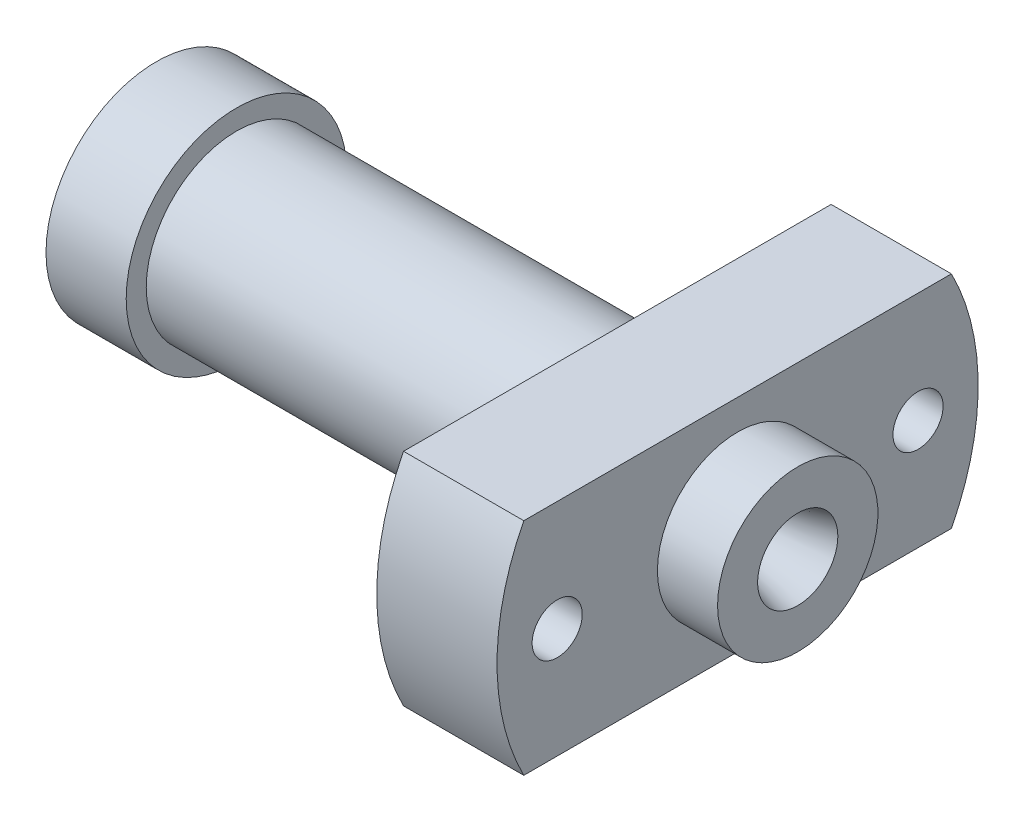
ISO-10303-21;
HEADER;
FILE_DESCRIPTION(('STEP AP214'),'2;1');
FILE_NAME('part.step','',(''),(''),'','','');
FILE_SCHEMA(('AUTOMOTIVE_DESIGN { 1 0 10303 214 1 1 1 1 }'));
ENDSEC;
DATA;
#1=APPLICATION_CONTEXT('core data for automotive mechanical design processes');
#2=APPLICATION_PROTOCOL_DEFINITION('international standard','automotive_design',2000,#1);
#3=PRODUCT_CONTEXT('',#1,'mechanical');
#4=PRODUCT('Part','Part','',(#3));
#5=PRODUCT_RELATED_PRODUCT_CATEGORY('part','',(#4));
#6=PRODUCT_DEFINITION_FORMATION('','',#4);
#7=PRODUCT_DEFINITION_CONTEXT('part definition',#1,'design');
#8=PRODUCT_DEFINITION('design','',#6,#7);
#9=PRODUCT_DEFINITION_SHAPE('','',#8);
#10=(LENGTH_UNIT() NAMED_UNIT(*) SI_UNIT(.MILLI.,.METRE.));
#11=(NAMED_UNIT(*) PLANE_ANGLE_UNIT() SI_UNIT($,.RADIAN.));
#12=(NAMED_UNIT(*) SI_UNIT($,.STERADIAN.) SOLID_ANGLE_UNIT());
#13=UNCERTAINTY_MEASURE_WITH_UNIT(LENGTH_MEASURE(1.E-05),#10,'distance_accuracy_value','');
#14=(GEOMETRIC_REPRESENTATION_CONTEXT(3) GLOBAL_UNCERTAINTY_ASSIGNED_CONTEXT((#13)) GLOBAL_UNIT_ASSIGNED_CONTEXT((#10,
#11,#12)) REPRESENTATION_CONTEXT('',''));
#15=CARTESIAN_POINT('',(0.,0.,0.));
#16=DIRECTION('',(0.,0.,1.));
#17=DIRECTION('',(1.,0.,0.));
#18=AXIS2_PLACEMENT_3D('',#15,#16,#17);
#19=CARTESIAN_POINT('',(-6.05996098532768,0.,0.));
#20=DIRECTION('',(-1.,0.,0.));
#21=DIRECTION('',(0.,0.,1.));
#22=AXIS2_PLACEMENT_3D('',#19,#20,#21);
#23=CYLINDRICAL_SURFACE('',#22,6.);
#24=CARTESIAN_POINT('',(14.5,0.,0.));
#25=DIRECTION('',(-1.,0.,0.));
#26=DIRECTION('',(0.,0.,1.));
#27=AXIS2_PLACEMENT_3D('',#24,#25,#26);
#28=CIRCLE('',#27,6.);
#29=CARTESIAN_POINT('',(14.5,2.75,-5.33268225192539));
#30=VERTEX_POINT('',#29);
#31=CARTESIAN_POINT('',(14.5,-2.75,-5.33268225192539));
#32=VERTEX_POINT('',#31);
#33=EDGE_CURVE('E89',#30,#32,#28,.T.);
#34=ORIENTED_EDGE('',*,*,#33,.T.);
#35=DIRECTION('',(1.,0.,0.));
#36=VECTOR('',#35,1.);
#37=CARTESIAN_POINT('',(10.5,-2.75,-5.33268225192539));
#38=LINE('',#37,#36);
#39=CARTESIAN_POINT('',(11.5,-2.75,-5.33268225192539));
#40=VERTEX_POINT('',#39);
#41=EDGE_CURVE('E74',#40,#32,#38,.T.);
#42=ORIENTED_EDGE('',*,*,#41,.F.);
#43=CARTESIAN_POINT('',(11.5,0.,0.));
#44=DIRECTION('',(-1.,0.,0.));
#45=DIRECTION('',(0.,0.,1.));
#46=AXIS2_PLACEMENT_3D('',#43,#44,#45);
#47=CIRCLE('',#46,6.);
#48=CARTESIAN_POINT('',(11.5,2.75,-5.33268225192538));
#49=VERTEX_POINT('',#48);
#50=EDGE_CURVE('E98',#49,#40,#47,.T.);
#51=ORIENTED_EDGE('',*,*,#50,.F.);
#52=DIRECTION('',(1.,0.,0.));
#53=VECTOR('',#52,1.);
#54=CARTESIAN_POINT('',(10.5,2.75,-5.33268225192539));
#55=LINE('',#54,#53);
#56=EDGE_CURVE('E57',#49,#30,#55,.T.);
#57=ORIENTED_EDGE('',*,*,#56,.T.);
#58=EDGE_LOOP('',(#34,#42,#51,#57));
#59=FACE_BOUND('',#58,.T.);
#60=ADVANCED_FACE('F35',(#59),#23,.T.);
#61=CARTESIAN_POINT('',(-6.05996098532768,0.,0.));
#62=DIRECTION('',(-1.,0.,0.));
#63=DIRECTION('',(0.,0.,1.));
#64=AXIS2_PLACEMENT_3D('',#61,#62,#63);
#65=CYLINDRICAL_SURFACE('',#64,2.75);
#66=CARTESIAN_POINT('',(0.,0.,0.));
#67=DIRECTION('',(-1.,0.,0.));
#68=DIRECTION('',(0.,0.,1.));
#69=AXIS2_PLACEMENT_3D('',#66,#67,#68);
#70=CIRCLE('',#69,2.75);
#71=CARTESIAN_POINT('',(0.,0.,2.75));
#72=VERTEX_POINT('',#71);
#73=EDGE_CURVE('E122',#72,#72,#70,.T.);
#74=ORIENTED_EDGE('',*,*,#73,.F.);
#75=EDGE_LOOP('',(#74));
#76=FACE_BOUND('',#75,.T.);
#77=CARTESIAN_POINT('',(2.,0.,0.));
#78=DIRECTION('',(-1.,0.,0.));
#79=DIRECTION('',(0.,0.,1.));
#80=AXIS2_PLACEMENT_3D('',#77,#78,#79);
#81=CIRCLE('',#80,2.75);
#82=CARTESIAN_POINT('',(2.,0.,2.75));
#83=VERTEX_POINT('',#82);
#84=EDGE_CURVE('E136',#83,#83,#81,.T.);
#85=ORIENTED_EDGE('',*,*,#84,.T.);
#86=EDGE_LOOP('',(#85));
#87=FACE_BOUND('',#86,.T.);
#88=ADVANCED_FACE('F37',(#76,#87),#65,.T.);
#89=CARTESIAN_POINT('',(0.,2.75,0.));
#90=DIRECTION('',(1.,0.,0.));
#91=DIRECTION('',(0.,0.,-1.));
#92=AXIS2_PLACEMENT_3D('',#89,#90,#91);
#93=PLANE('',#92);
#94=CARTESIAN_POINT('',(0.,0.,0.));
#95=DIRECTION('',(-1.,0.,0.));
#96=DIRECTION('',(0.,0.,1.));
#97=AXIS2_PLACEMENT_3D('',#94,#95,#96);
#98=CIRCLE('',#97,2.);
#99=CARTESIAN_POINT('',(0.,0.,2.));
#100=VERTEX_POINT('',#99);
#101=EDGE_CURVE('E119',#100,#100,#98,.T.);
#102=ORIENTED_EDGE('',*,*,#101,.F.);
#103=EDGE_LOOP('',(#102));
#104=FACE_BOUND('',#103,.T.);
#105=ORIENTED_EDGE('',*,*,#73,.T.);
#106=EDGE_LOOP('',(#105));
#107=FACE_BOUND('',#106,.T.);
#108=ADVANCED_FACE('F193',(#104,#107),#93,.F.);
#109=CARTESIAN_POINT('',(0.,0.,0.));
#110=DIRECTION('',(-1.,0.,0.));
#111=DIRECTION('',(0.,0.,1.));
#112=AXIS2_PLACEMENT_3D('',#109,#110,#111);
#113=CONICAL_SURFACE('',#112,2.,0.31415926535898);
#114=CARTESIAN_POINT('',(2.30826265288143,0.,0.));
#115=DIRECTION('',(-1.,0.,0.));
#116=DIRECTION('',(0.,0.,1.));
#117=AXIS2_PLACEMENT_3D('',#114,#115,#116);
#118=CIRCLE('',#117,1.25);
#119=CARTESIAN_POINT('',(2.30826265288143,0.,1.25));
#120=VERTEX_POINT('',#119);
#121=EDGE_CURVE('E116',#120,#120,#118,.T.);
#122=ORIENTED_EDGE('',*,*,#121,.F.);
#123=EDGE_LOOP('',(#122));
#124=FACE_BOUND('',#123,.T.);
#125=ORIENTED_EDGE('',*,*,#101,.T.);
#126=EDGE_LOOP('',(#125));
#127=FACE_BOUND('',#126,.T.);
#128=ADVANCED_FACE('F218',(#124,#127),#113,.F.);
#129=CARTESIAN_POINT('',(-6.05996098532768,0.,0.));
#130=DIRECTION('',(-1.,0.,0.));
#131=DIRECTION('',(0.,0.,1.));
#132=AXIS2_PLACEMENT_3D('',#129,#130,#131);
#133=CYLINDRICAL_SURFACE('',#132,1.25);
#134=CARTESIAN_POINT('',(11.7501645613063,0.,0.));
#135=DIRECTION('',(-1.,0.,0.));
#136=DIRECTION('',(0.,0.,1.));
#137=AXIS2_PLACEMENT_3D('',#134,#135,#136);
#138=CIRCLE('',#137,1.25);
#139=CARTESIAN_POINT('',(11.7501645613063,0.,1.25));
#140=VERTEX_POINT('',#139);
#141=EDGE_CURVE('E113',#140,#140,#138,.T.);
#142=ORIENTED_EDGE('',*,*,#141,.F.);
#143=EDGE_LOOP('',(#142));
#144=FACE_BOUND('',#143,.T.);
#145=ORIENTED_EDGE('',*,*,#121,.T.);
#146=EDGE_LOOP('',(#145));
#147=FACE_BOUND('',#146,.T.);
#148=ADVANCED_FACE('F214',(#144,#147),#133,.F.);
#149=CARTESIAN_POINT('',(11.7501645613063,0.,0.));
#150=DIRECTION('',(-1.,0.,0.));
#151=DIRECTION('',(0.,0.,1.));
#152=AXIS2_PLACEMENT_3D('',#149,#150,#151);
#153=CONICAL_SURFACE('',#152,1.25,1.02974425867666);
#154=CARTESIAN_POINT('',(12.441154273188,0.,0.));
#155=DIRECTION('',(-1.,0.,0.));
#156=DIRECTION('',(0.,0.,1.));
#157=AXIS2_PLACEMENT_3D('',#154,#155,#156);
#158=CIRCLE('',#157,0.1);
#159=CARTESIAN_POINT('',(12.441154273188,0.,0.0999999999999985));
#160=VERTEX_POINT('',#159);
#161=EDGE_CURVE('E110',#160,#160,#158,.T.);
#162=CARTESIAN_POINT('',(12.441154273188,0.,0.0999999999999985));
#163=CARTESIAN_POINT('',(12.4339564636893,0.,0.111979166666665));
#164=CARTESIAN_POINT('',(12.4267586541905,0.,0.123958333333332));
#165=CARTESIAN_POINT('',(12.412363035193,0.,0.147916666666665));
#166=CARTESIAN_POINT('',(12.4051652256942,0.,0.159895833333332));
#167=CARTESIAN_POINT('',(12.3907696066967,0.,0.183854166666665));
#168=CARTESIAN_POINT('',(12.3835717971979,0.,0.195833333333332));
#169=CARTESIAN_POINT('',(12.3691761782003,0.,0.219791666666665));
#170=CARTESIAN_POINT('',(12.3619783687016,0.,0.231770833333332));
#171=CARTESIAN_POINT('',(12.347582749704,0.,0.255729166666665));
#172=CARTESIAN_POINT('',(12.3403849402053,0.,0.267708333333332));
#173=CARTESIAN_POINT('',(12.3259893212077,0.,0.291666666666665));
#174=CARTESIAN_POINT('',(12.318791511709,0.,0.303645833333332));
#175=CARTESIAN_POINT('',(12.3043958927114,0.,0.327604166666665));
#176=CARTESIAN_POINT('',(12.2971980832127,0.,0.339583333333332));
#177=CARTESIAN_POINT('',(12.2828024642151,0.,0.363541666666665));
#178=CARTESIAN_POINT('',(12.2756046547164,0.,0.375520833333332));
#179=CARTESIAN_POINT('',(12.2612090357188,0.,0.399479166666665));
#180=CARTESIAN_POINT('',(12.2540112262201,0.,0.411458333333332));
#181=CARTESIAN_POINT('',(12.2396156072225,0.,0.435416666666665));
#182=CARTESIAN_POINT('',(12.2324177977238,0.,0.447395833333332));
#183=CARTESIAN_POINT('',(12.2180221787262,0.,0.471354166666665));
#184=CARTESIAN_POINT('',(12.2108243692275,0.,0.483333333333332));
#185=CARTESIAN_POINT('',(12.1964287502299,0.,0.507291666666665));
#186=CARTESIAN_POINT('',(12.1892309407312,0.,0.519270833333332));
#187=CARTESIAN_POINT('',(12.1748353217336,0.,0.543229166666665));
#188=CARTESIAN_POINT('',(12.1676375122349,0.,0.555208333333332));
#189=CARTESIAN_POINT('',(12.1532418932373,0.,0.579166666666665));
#190=CARTESIAN_POINT('',(12.1460440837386,0.,0.591145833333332));
#191=CARTESIAN_POINT('',(12.131648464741,0.,0.615104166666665));
#192=CARTESIAN_POINT('',(12.1244506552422,0.,0.627083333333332));
#193=CARTESIAN_POINT('',(12.1100550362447,0.,0.651041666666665));
#194=CARTESIAN_POINT('',(12.1028572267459,0.,0.663020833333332));
#195=CARTESIAN_POINT('',(12.0884616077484,0.,0.686979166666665));
#196=CARTESIAN_POINT('',(12.0812637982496,0.,0.698958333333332));
#197=CARTESIAN_POINT('',(12.0668681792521,0.,0.722916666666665));
#198=CARTESIAN_POINT('',(12.0596703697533,0.,0.734895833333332));
#199=CARTESIAN_POINT('',(12.0452747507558,0.,0.758854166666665));
#200=CARTESIAN_POINT('',(12.038076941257,0.,0.770833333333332));
#201=CARTESIAN_POINT('',(12.0236813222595,0.,0.794791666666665));
#202=CARTESIAN_POINT('',(12.0164835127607,0.,0.806770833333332));
#203=CARTESIAN_POINT('',(12.0020878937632,0.,0.830729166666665));
#204=CARTESIAN_POINT('',(11.9948900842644,0.,0.842708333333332));
#205=CARTESIAN_POINT('',(11.9804944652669,0.,0.866666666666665));
#206=CARTESIAN_POINT('',(11.9732966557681,0.,0.878645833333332));
#207=CARTESIAN_POINT('',(11.9589010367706,0.,0.902604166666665));
#208=CARTESIAN_POINT('',(11.9517032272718,0.,0.914583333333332));
#209=CARTESIAN_POINT('',(11.9373076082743,0.,0.938541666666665));
#210=CARTESIAN_POINT('',(11.9301097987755,0.,0.950520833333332));
#211=CARTESIAN_POINT('',(11.915714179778,0.,0.974479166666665));
#212=CARTESIAN_POINT('',(11.9085163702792,0.,0.986458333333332));
#213=CARTESIAN_POINT('',(11.8941207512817,0.,1.01041666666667));
#214=CARTESIAN_POINT('',(11.8869229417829,0.,1.02239583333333));
#215=CARTESIAN_POINT('',(11.8725273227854,0.,1.04635416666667));
#216=CARTESIAN_POINT('',(11.8653295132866,0.,1.05833333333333));
#217=CARTESIAN_POINT('',(11.8509338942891,0.,1.08229166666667));
#218=CARTESIAN_POINT('',(11.8437360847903,0.,1.09427083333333));
#219=CARTESIAN_POINT('',(11.8293404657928,0.,1.11822916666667));
#220=CARTESIAN_POINT('',(11.822142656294,0.,1.13020833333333));
#221=CARTESIAN_POINT('',(11.8077470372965,0.,1.15416666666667));
#222=CARTESIAN_POINT('',(11.8005492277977,0.,1.16614583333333));
#223=CARTESIAN_POINT('',(11.7861536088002,0.,1.19010416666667));
#224=CARTESIAN_POINT('',(11.7789557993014,0.,1.20208333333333));
#225=CARTESIAN_POINT('',(11.7645601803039,0.,1.22604166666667));
#226=CARTESIAN_POINT('',(11.7573623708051,0.,1.23802083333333));
#227=CARTESIAN_POINT('',(11.7501645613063,0.,1.25));
#228=B_SPLINE_CURVE_WITH_KNOTS('',3,(#162,#163,#164,#165,#166,#167,#168,#169,#170,#171,#172,
#173,#174,#175,#176,#177,#178,#179,#180,#181,#182,#183,#184,#185,#186,#187,#188,#189,#190,#191,
#192,#193,#194,#195,#196,#197,#198,#199,#200,#201,#202,#203,#204,#205,#206,#207,#208,#209,#210,
#211,#212,#213,#214,#215,#216,#217,#218,#219,#220,#221,#222,#223,#224,#225,#226,#227),
.UNSPECIFIED.,.F.,.F.,(4,2,2,2,2,2,2,2,2,2,2,2,2,2,2,2,2,2,2,2,2,2,2,2,2,2,2,2,2,2,2,2,4),(0.,
0.0419258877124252,0.0838517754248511,0.125777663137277,0.167703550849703,0.209629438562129,
0.251555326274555,0.293481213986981,0.335407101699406,0.377332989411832,0.419258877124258,
0.461184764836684,0.50311065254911,0.545036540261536,0.586962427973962,0.628888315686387,
0.670814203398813,0.712740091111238,0.754665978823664,0.79659186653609,0.838517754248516,
0.880443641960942,0.922369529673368,0.964295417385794,1.00622130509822,1.04814719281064,
1.09007308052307,1.1319989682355,1.17392485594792,1.21585074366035,1.25777663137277,
1.2997025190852,1.34162840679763),.UNSPECIFIED.);
#229=EDGE_CURVE('BSEAM210',#160,#140,#228,.T.);
#230=ORIENTED_EDGE('',*,*,#161,.F.);
#231=ORIENTED_EDGE('',*,*,#141,.T.);
#232=ORIENTED_EDGE('',*,*,#229,.T.);
#233=ORIENTED_EDGE('',*,*,#229,.F.);
#234=EDGE_LOOP('',(#230,#232,#231,#233));
#235=FACE_BOUND('',#234,.T.);
#236=ADVANCED_FACE('F210',(#235),#153,.F.);
#237=CARTESIAN_POINT('',(-6.05996098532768,0.,0.));
#238=DIRECTION('',(-1.,0.,0.));
#239=DIRECTION('',(0.,0.,1.));
#240=AXIS2_PLACEMENT_3D('',#237,#238,#239);
#241=CYLINDRICAL_SURFACE('',#240,0.1);
#242=CARTESIAN_POINT('',(12.641154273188,0.,0.));
#243=DIRECTION('',(-1.,0.,0.));
#244=DIRECTION('',(0.,0.,1.));
#245=AXIS2_PLACEMENT_3D('',#242,#243,#244);
#246=CIRCLE('',#245,0.1);
#247=CARTESIAN_POINT('',(12.641154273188,0.,-0.1));
#248=VERTEX_POINT('',#247);
#249=EDGE_CURVE('E107',#248,#248,#246,.T.);
#250=ORIENTED_EDGE('',*,*,#249,.F.);
#251=EDGE_LOOP('',(#250));
#252=FACE_BOUND('',#251,.T.);
#253=ORIENTED_EDGE('',*,*,#161,.T.);
#254=EDGE_LOOP('',(#253));
#255=FACE_BOUND('',#254,.T.);
#256=ADVANCED_FACE('F206',(#252,#255),#241,.F.);
#257=CARTESIAN_POINT('',(12.641154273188,0.,0.));
#258=DIRECTION('',(1.,0.,0.));
#259=DIRECTION('',(0.,0.,-1.));
#260=AXIS2_PLACEMENT_3D('',#257,#258,#259);
#261=CONICAL_SURFACE('',#260,0.1,0.26179938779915);
#262=CARTESIAN_POINT('',(16.,0.,0.));
#263=DIRECTION('',(-1.,0.,0.));
#264=DIRECTION('',(0.,0.,1.));
#265=AXIS2_PLACEMENT_3D('',#262,#263,#264);
#266=CIRCLE('',#265,1.);
#267=CARTESIAN_POINT('',(16.,0.,-1.));
#268=VERTEX_POINT('',#267);
#269=EDGE_CURVE('E104',#268,#268,#266,.T.);
#270=CARTESIAN_POINT('',(16.,0.,-1.));
#271=CARTESIAN_POINT('',(15.965012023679,0.,-0.990625));
#272=CARTESIAN_POINT('',(15.9300240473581,0.,-0.98125));
#273=CARTESIAN_POINT('',(15.8600480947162,0.,-0.9625));
#274=CARTESIAN_POINT('',(15.8250601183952,0.,-0.953125));
#275=CARTESIAN_POINT('',(15.7550841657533,0.,-0.934375));
#276=CARTESIAN_POINT('',(15.7200961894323,0.,-0.925));
#277=CARTESIAN_POINT('',(15.6501202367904,0.,-0.90625));
#278=CARTESIAN_POINT('',(15.6151322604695,0.,-0.896875));
#279=CARTESIAN_POINT('',(15.5451563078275,0.,-0.878125));
#280=CARTESIAN_POINT('',(15.5101683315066,0.,-0.86875));
#281=CARTESIAN_POINT('',(15.4401923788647,0.,-0.85));
#282=CARTESIAN_POINT('',(15.4052044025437,0.,-0.840625));
#283=CARTESIAN_POINT('',(15.3352284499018,0.,-0.821875));
#284=CARTESIAN_POINT('',(15.3002404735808,0.,-0.8125));
#285=CARTESIAN_POINT('',(15.2302645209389,0.,-0.79375));
#286=CARTESIAN_POINT('',(15.195276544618,0.,-0.784375));
#287=CARTESIAN_POINT('',(15.125300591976,0.,-0.765625));
#288=CARTESIAN_POINT('',(15.0903126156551,0.,-0.75625));
#289=CARTESIAN_POINT('',(15.0203366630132,0.,-0.7375));
#290=CARTESIAN_POINT('',(14.9853486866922,0.,-0.728125));
#291=CARTESIAN_POINT('',(14.9153727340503,0.,-0.709375));
#292=CARTESIAN_POINT('',(14.8803847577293,0.,-0.7));
#293=CARTESIAN_POINT('',(14.8104088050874,0.,-0.68125));
#294=CARTESIAN_POINT('',(14.7754208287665,0.,-0.671875));
#295=CARTESIAN_POINT('',(14.7054448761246,0.,-0.653125));
#296=CARTESIAN_POINT('',(14.6704568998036,0.,-0.64375));
#297=CARTESIAN_POINT('',(14.6004809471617,0.,-0.625));
#298=CARTESIAN_POINT('',(14.5654929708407,0.,-0.615625));
#299=CARTESIAN_POINT('',(14.4955170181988,0.,-0.596875));
#300=CARTESIAN_POINT('',(14.4605290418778,0.,-0.5875));
#301=CARTESIAN_POINT('',(14.3905530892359,0.,-0.56875));
#302=CARTESIAN_POINT('',(14.355565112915,0.,-0.559375));
#303=CARTESIAN_POINT('',(14.2855891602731,0.,-0.540625));
#304=CARTESIAN_POINT('',(14.2506011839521,0.,-0.53125));
#305=CARTESIAN_POINT('',(14.1806252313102,0.,-0.5125));
#306=CARTESIAN_POINT('',(14.1456372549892,0.,-0.503125));
#307=CARTESIAN_POINT('',(14.0756613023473,0.,-0.484375));
#308=CARTESIAN_POINT('',(14.0406733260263,0.,-0.475));
#309=CARTESIAN_POINT('',(13.9706973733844,0.,-0.45625));
#310=CARTESIAN_POINT('',(13.9357093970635,0.,-0.446875));
#311=CARTESIAN_POINT('',(13.8657334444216,0.,-0.428125));
#312=CARTESIAN_POINT('',(13.8307454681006,0.,-0.41875));
#313=CARTESIAN_POINT('',(13.7607695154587,0.,-0.4));
#314=CARTESIAN_POINT('',(13.7257815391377,0.,-0.390625));
#315=CARTESIAN_POINT('',(13.6558055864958,0.,-0.371875));
#316=CARTESIAN_POINT('',(13.6208176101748,0.,-0.3625));
#317=CARTESIAN_POINT('',(13.5508416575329,0.,-0.34375));
#318=CARTESIAN_POINT('',(13.515853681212,0.,-0.334375));
#319=CARTESIAN_POINT('',(13.4458777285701,0.,-0.315625));
#320=CARTESIAN_POINT('',(13.4108897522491,0.,-0.30625));
#321=CARTESIAN_POINT('',(13.3409137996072,0.,-0.2875));
#322=CARTESIAN_POINT('',(13.3059258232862,0.,-0.278125));
#323=CARTESIAN_POINT('',(13.2359498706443,0.,-0.259375));
#324=CARTESIAN_POINT('',(13.2009618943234,0.,-0.25));
#325=CARTESIAN_POINT('',(13.1309859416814,0.,-0.23125));
#326=CARTESIAN_POINT('',(13.0959979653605,0.,-0.221875));
#327=CARTESIAN_POINT('',(13.0260220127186,0.,-0.203125));
#328=CARTESIAN_POINT('',(12.9910340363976,0.,-0.19375));
#329=CARTESIAN_POINT('',(12.9210580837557,0.,-0.175));
#330=CARTESIAN_POINT('',(12.8860701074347,0.,-0.165625));
#331=CARTESIAN_POINT('',(12.8160941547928,0.,-0.146875));
#332=CARTESIAN_POINT('',(12.7811061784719,0.,-0.1375));
#333=CARTESIAN_POINT('',(12.7111302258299,0.,-0.11875));
#334=CARTESIAN_POINT('',(12.676142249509,0.,-0.109375));
#335=CARTESIAN_POINT('',(12.641154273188,0.,-0.1));
#336=B_SPLINE_CURVE_WITH_KNOTS('',3,(#270,#271,#272,#273,#274,#275,#276,#277,#278,#279,#280,
#281,#282,#283,#284,#285,#286,#287,#288,#289,#290,#291,#292,#293,#294,#295,#296,#297,#298,#299,
#300,#301,#302,#303,#304,#305,#306,#307,#308,#309,#310,#311,#312,#313,#314,#315,#316,#317,#318,
#319,#320,#321,#322,#323,#324,#325,#326,#327,#328,#329,#330,#331,#332,#333,#334,#335),
.UNSPECIFIED.,.F.,.F.,(4,2,2,2,2,2,2,2,2,2,2,2,2,2,2,2,2,2,2,2,2,2,2,2,2,2,2,2,2,2,2,2,4),(0.,
0.108666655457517,0.217333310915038,0.325999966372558,0.434666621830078,0.543333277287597,
0.651999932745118,0.760666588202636,0.869333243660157,0.977999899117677,1.0866665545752,
1.19533321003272,1.30399986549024,1.41266652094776,1.52133317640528,1.6299998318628,
1.73866648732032,1.84733314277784,1.95599979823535,2.06466645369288,2.1733331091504,
2.28199976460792,2.39066642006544,2.49933307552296,2.60799973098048,2.716666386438,
2.82533304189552,2.93399969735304,3.04266635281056,3.15133300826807,3.2599996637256,
3.36866631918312,3.47733297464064),.UNSPECIFIED.);
#337=EDGE_CURVE('BSEAM202',#268,#248,#336,.T.);
#338=ORIENTED_EDGE('',*,*,#269,.F.);
#339=ORIENTED_EDGE('',*,*,#249,.T.);
#340=ORIENTED_EDGE('',*,*,#337,.T.);
#341=ORIENTED_EDGE('',*,*,#337,.F.);
#342=EDGE_LOOP('',(#338,#340,#339,#341));
#343=FACE_BOUND('',#342,.T.);
#344=ADVANCED_FACE('F202',(#343),#261,.F.);
#345=CARTESIAN_POINT('',(16.,1.,0.));
#346=DIRECTION('',(-1.,0.,0.));
#347=DIRECTION('',(0.,0.,1.));
#348=AXIS2_PLACEMENT_3D('',#345,#346,#347);
#349=PLANE('',#348);
#350=CARTESIAN_POINT('',(16.,0.,0.));
#351=DIRECTION('',(-1.,0.,0.));
#352=DIRECTION('',(0.,0.,1.));
#353=AXIS2_PLACEMENT_3D('',#350,#351,#352);
#354=CIRCLE('',#353,2.);
#355=CARTESIAN_POINT('',(16.,0.,2.));
#356=VERTEX_POINT('',#355);
#357=EDGE_CURVE('E96',#356,#356,#354,.T.);
#358=ORIENTED_EDGE('',*,*,#357,.F.);
#359=EDGE_LOOP('',(#358));
#360=FACE_BOUND('',#359,.T.);
#361=ORIENTED_EDGE('',*,*,#269,.T.);
#362=EDGE_LOOP('',(#361));
#363=FACE_BOUND('',#362,.T.);
#364=ADVANCED_FACE('F198',(#360,#363),#349,.F.);
#365=CARTESIAN_POINT('',(-6.05996098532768,0.,0.));
#366=DIRECTION('',(-1.,0.,0.));
#367=DIRECTION('',(0.,0.,1.));
#368=AXIS2_PLACEMENT_3D('',#365,#366,#367);
#369=CYLINDRICAL_SURFACE('',#368,2.);
#370=CARTESIAN_POINT('',(14.5,0.,0.));
#371=DIRECTION('',(-1.,0.,0.));
#372=DIRECTION('',(0.,0.,1.));
#373=AXIS2_PLACEMENT_3D('',#370,#371,#372);
#374=CIRCLE('',#373,2.);
#375=CARTESIAN_POINT('',(14.5,0.,2.));
#376=VERTEX_POINT('',#375);
#377=EDGE_CURVE('E93',#376,#376,#374,.T.);
#378=ORIENTED_EDGE('',*,*,#377,.F.);
#379=EDGE_LOOP('',(#378));
#380=FACE_BOUND('',#379,.T.);
#381=ORIENTED_EDGE('',*,*,#357,.T.);
#382=EDGE_LOOP('',(#381));
#383=FACE_BOUND('',#382,.T.);
#384=ADVANCED_FACE('F165',(#380,#383),#369,.T.);
#385=CARTESIAN_POINT('',(14.5,2.,0.));
#386=DIRECTION('',(-1.,0.,0.));
#387=DIRECTION('',(0.,0.,1.));
#388=AXIS2_PLACEMENT_3D('',#385,#386,#387);
#389=PLANE('',#388);
#390=CARTESIAN_POINT('',(14.5,0.,4.5));
#391=DIRECTION('',(1.,0.,0.));
#392=DIRECTION('',(0.,0.,-1.));
#393=AXIS2_PLACEMENT_3D('',#390,#391,#392);
#394=CIRCLE('',#393,0.624999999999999);
#395=CARTESIAN_POINT('',(14.5,0.,3.875));
#396=VERTEX_POINT('',#395);
#397=EDGE_CURVE('E155',#396,#396,#394,.T.);
#398=ORIENTED_EDGE('',*,*,#397,.F.);
#399=EDGE_LOOP('',(#398));
#400=FACE_BOUND('',#399,.T.);
#401=CARTESIAN_POINT('',(14.5,0.,-4.5));
#402=DIRECTION('',(1.,0.,0.));
#403=DIRECTION('',(0.,0.,-1.));
#404=AXIS2_PLACEMENT_3D('',#401,#402,#403);
#405=CIRCLE('',#404,0.624999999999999);
#406=CARTESIAN_POINT('',(14.5,0.,-5.125));
#407=VERTEX_POINT('',#406);
#408=EDGE_CURVE('E149',#407,#407,#405,.T.);
#409=ORIENTED_EDGE('',*,*,#408,.F.);
#410=EDGE_LOOP('',(#409));
#411=FACE_BOUND('',#410,.T.);
#412=CARTESIAN_POINT('',(14.5,-2.75,5.33268225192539));
#413=VERTEX_POINT('',#412);
#414=CARTESIAN_POINT('',(14.5,2.75,5.33268225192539));
#415=VERTEX_POINT('',#414);
#416=EDGE_CURVE('E90',#413,#415,#28,.T.);
#417=ORIENTED_EDGE('',*,*,#416,.F.);
#418=DIRECTION('',(0.,0.,1.));
#419=VECTOR('',#418,1.);
#420=CARTESIAN_POINT('',(14.5,-2.75,5.33268225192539));
#421=LINE('',#420,#419);
#422=EDGE_CURVE('E77',#32,#413,#421,.T.);
#423=ORIENTED_EDGE('',*,*,#422,.F.);
#424=ORIENTED_EDGE('',*,*,#33,.F.);
#425=DIRECTION('',(0.,0.,-1.));
#426=VECTOR('',#425,1.);
#427=CARTESIAN_POINT('',(14.5,2.75,5.33268225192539));
#428=LINE('',#427,#426);
#429=EDGE_CURVE('E143',#415,#30,#428,.T.);
#430=ORIENTED_EDGE('',*,*,#429,.F.);
#431=EDGE_LOOP('',(#417,#423,#424,#430));
#432=FACE_BOUND('',#431,.T.);
#433=ORIENTED_EDGE('',*,*,#377,.T.);
#434=EDGE_LOOP('',(#433));
#435=FACE_BOUND('',#434,.T.);
#436=ADVANCED_FACE('F86',(#400,#411,#432,#435),#389,.F.);
#437=CARTESIAN_POINT('',(11.5,-2.75,5.33268225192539));
#438=VERTEX_POINT('',#437);
#439=CARTESIAN_POINT('',(11.5,2.75,5.33268225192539));
#440=VERTEX_POINT('',#439);
#441=EDGE_CURVE('E127',#438,#440,#47,.T.);
#442=ORIENTED_EDGE('',*,*,#441,.F.);
#443=DIRECTION('',(1.,0.,0.));
#444=VECTOR('',#443,1.);
#445=CARTESIAN_POINT('',(10.5,-2.75,5.33268225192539));
#446=LINE('',#445,#444);
#447=EDGE_CURVE('E50',#438,#413,#446,.T.);
#448=ORIENTED_EDGE('',*,*,#447,.T.);
#449=ORIENTED_EDGE('',*,*,#416,.T.);
#450=DIRECTION('',(1.,0.,0.));
#451=VECTOR('',#450,1.);
#452=CARTESIAN_POINT('',(10.5,2.75,5.33268225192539));
#453=LINE('',#452,#451);
#454=EDGE_CURVE('E141',#440,#415,#453,.T.);
#455=ORIENTED_EDGE('',*,*,#454,.F.);
#456=EDGE_LOOP('',(#442,#448,#449,#455));
#457=FACE_BOUND('',#456,.T.);
#458=ADVANCED_FACE('F164',(#457),#23,.T.);
#459=CARTESIAN_POINT('',(11.5,6.,0.));
#460=DIRECTION('',(1.,0.,0.));
#461=DIRECTION('',(0.,0.,-1.));
#462=AXIS2_PLACEMENT_3D('',#459,#460,#461);
#463=PLANE('',#462);
#464=CARTESIAN_POINT('',(11.5,0.,4.5));
#465=DIRECTION('',(1.,0.,0.));
#466=DIRECTION('',(0.,0.,-1.));
#467=AXIS2_PLACEMENT_3D('',#464,#465,#466);
#468=CIRCLE('',#467,0.624999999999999);
#469=CARTESIAN_POINT('',(11.5,0.,3.875));
#470=VERTEX_POINT('',#469);
#471=EDGE_CURVE('E152',#470,#470,#468,.T.);
#472=ORIENTED_EDGE('',*,*,#471,.T.);
#473=EDGE_LOOP('',(#472));
#474=FACE_BOUND('',#473,.T.);
#475=CARTESIAN_POINT('',(11.5,0.,-4.5));
#476=DIRECTION('',(1.,0.,0.));
#477=DIRECTION('',(0.,0.,-1.));
#478=AXIS2_PLACEMENT_3D('',#475,#476,#477);
#479=CIRCLE('',#478,0.624999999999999);
#480=CARTESIAN_POINT('',(11.5,0.,-5.125));
#481=VERTEX_POINT('',#480);
#482=EDGE_CURVE('E91',#481,#481,#479,.T.);
#483=ORIENTED_EDGE('',*,*,#482,.T.);
#484=EDGE_LOOP('',(#483));
#485=FACE_BOUND('',#484,.T.);
#486=CARTESIAN_POINT('',(11.5,0.,0.));
#487=DIRECTION('',(-1.,0.,0.));
#488=DIRECTION('',(0.,0.,1.));
#489=AXIS2_PLACEMENT_3D('',#486,#487,#488);
#490=CIRCLE('',#489,2.25);
#491=CARTESIAN_POINT('',(11.5,0.,2.25));
#492=VERTEX_POINT('',#491);
#493=EDGE_CURVE('E130',#492,#492,#490,.T.);
#494=ORIENTED_EDGE('',*,*,#493,.F.);
#495=EDGE_LOOP('',(#494));
#496=FACE_BOUND('',#495,.T.);
#497=ORIENTED_EDGE('',*,*,#50,.T.);
#498=DIRECTION('',(0.,0.,1.));
#499=VECTOR('',#498,1.);
#500=CARTESIAN_POINT('',(11.5,-2.75,0.));
#501=LINE('',#500,#499);
#502=EDGE_CURVE('E11',#40,#438,#501,.T.);
#503=ORIENTED_EDGE('',*,*,#502,.T.);
#504=ORIENTED_EDGE('',*,*,#441,.T.);
#505=DIRECTION('',(0.,0.,-1.));
#506=VECTOR('',#505,1.);
#507=CARTESIAN_POINT('',(11.5,2.75,0.));
#508=LINE('',#507,#506);
#509=EDGE_CURVE('E43',#440,#49,#508,.T.);
#510=ORIENTED_EDGE('',*,*,#509,.T.);
#511=EDGE_LOOP('',(#497,#503,#504,#510));
#512=FACE_BOUND('',#511,.T.);
#513=ADVANCED_FACE('F125',(#474,#485,#496,#512),#463,.F.);
#514=CARTESIAN_POINT('',(-6.05996098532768,0.,0.));
#515=DIRECTION('',(-1.,0.,0.));
#516=DIRECTION('',(0.,0.,1.));
#517=AXIS2_PLACEMENT_3D('',#514,#515,#516);
#518=CYLINDRICAL_SURFACE('',#517,2.25);
#519=CARTESIAN_POINT('',(2.,0.,0.));
#520=DIRECTION('',(-1.,0.,0.));
#521=DIRECTION('',(0.,0.,1.));
#522=AXIS2_PLACEMENT_3D('',#519,#520,#521);
#523=CIRCLE('',#522,2.25);
#524=CARTESIAN_POINT('',(2.,0.,2.25));
#525=VERTEX_POINT('',#524);
#526=EDGE_CURVE('E132',#525,#525,#523,.T.);
#527=ORIENTED_EDGE('',*,*,#526,.F.);
#528=EDGE_LOOP('',(#527));
#529=FACE_BOUND('',#528,.T.);
#530=ORIENTED_EDGE('',*,*,#493,.T.);
#531=EDGE_LOOP('',(#530));
#532=FACE_BOUND('',#531,.T.);
#533=ADVANCED_FACE('F177',(#529,#532),#518,.T.);
#534=CARTESIAN_POINT('',(2.,2.25,0.));
#535=DIRECTION('',(-1.,0.,0.));
#536=DIRECTION('',(0.,0.,1.));
#537=AXIS2_PLACEMENT_3D('',#534,#535,#536);
#538=PLANE('',#537);
#539=ORIENTED_EDGE('',*,*,#84,.F.);
#540=EDGE_LOOP('',(#539));
#541=FACE_BOUND('',#540,.T.);
#542=ORIENTED_EDGE('',*,*,#526,.T.);
#543=EDGE_LOOP('',(#542));
#544=FACE_BOUND('',#543,.T.);
#545=ADVANCED_FACE('F184',(#541,#544),#538,.F.);
#546=CARTESIAN_POINT('',(10.5,2.75,5.33268225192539));
#547=DIRECTION('',(0.,-1.,0.));
#548=DIRECTION('',(0.,0.,-1.));
#549=AXIS2_PLACEMENT_3D('',#546,#547,#548);
#550=PLANE('',#549);
#551=ORIENTED_EDGE('',*,*,#454,.T.);
#552=ORIENTED_EDGE('',*,*,#429,.T.);
#553=ORIENTED_EDGE('',*,*,#56,.F.);
#554=ORIENTED_EDGE('',*,*,#509,.F.);
#555=EDGE_LOOP('',(#551,#552,#553,#554));
#556=FACE_BOUND('',#555,.T.);
#557=ADVANCED_FACE('F234',(#556),#550,.F.);
#558=CARTESIAN_POINT('',(10.5,-2.75,5.33268225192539));
#559=DIRECTION('',(0.,1.,0.));
#560=DIRECTION('',(0.,0.,1.));
#561=AXIS2_PLACEMENT_3D('',#558,#559,#560);
#562=PLANE('',#561);
#563=ORIENTED_EDGE('',*,*,#41,.T.);
#564=ORIENTED_EDGE('',*,*,#422,.T.);
#565=ORIENTED_EDGE('',*,*,#447,.F.);
#566=ORIENTED_EDGE('',*,*,#502,.F.);
#567=EDGE_LOOP('',(#563,#564,#565,#566));
#568=FACE_BOUND('',#567,.T.);
#569=ADVANCED_FACE('F76',(#568),#562,.F.);
#570=CARTESIAN_POINT('',(14.5,0.,-4.5));
#571=DIRECTION('',(1.,0.,0.));
#572=DIRECTION('',(0.,0.,-1.));
#573=AXIS2_PLACEMENT_3D('',#570,#571,#572);
#574=CYLINDRICAL_SURFACE('',#573,0.624999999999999);
#575=ORIENTED_EDGE('',*,*,#408,.T.);
#576=EDGE_LOOP('',(#575));
#577=FACE_BOUND('',#576,.T.);
#578=ORIENTED_EDGE('',*,*,#482,.F.);
#579=EDGE_LOOP('',(#578));
#580=FACE_BOUND('',#579,.T.);
#581=ADVANCED_FACE('F169',(#577,#580),#574,.F.);
#582=CARTESIAN_POINT('',(14.5,0.,4.5));
#583=DIRECTION('',(1.,0.,0.));
#584=DIRECTION('',(0.,0.,-1.));
#585=AXIS2_PLACEMENT_3D('',#582,#583,#584);
#586=CYLINDRICAL_SURFACE('',#585,0.624999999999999);
#587=ORIENTED_EDGE('',*,*,#397,.T.);
#588=EDGE_LOOP('',(#587));
#589=FACE_BOUND('',#588,.T.);
#590=ORIENTED_EDGE('',*,*,#471,.F.);
#591=EDGE_LOOP('',(#590));
#592=FACE_BOUND('',#591,.T.);
#593=ADVANCED_FACE('F159',(#589,#592),#586,.F.);
#594=CLOSED_SHELL('',(#60,#88,#108,#128,#148,#236,#256,#344,#364,#384,#436,#458,#513,#533,#545,
#557,#569,#581,#593));
#595=MANIFOLD_SOLID_BREP('B2',#594);
#596=ADVANCED_BREP_SHAPE_REPRESENTATION('',(#18,#595),#14);
#597=SHAPE_DEFINITION_REPRESENTATION(#9,#596);
ENDSEC;
END-ISO-10303-21;
